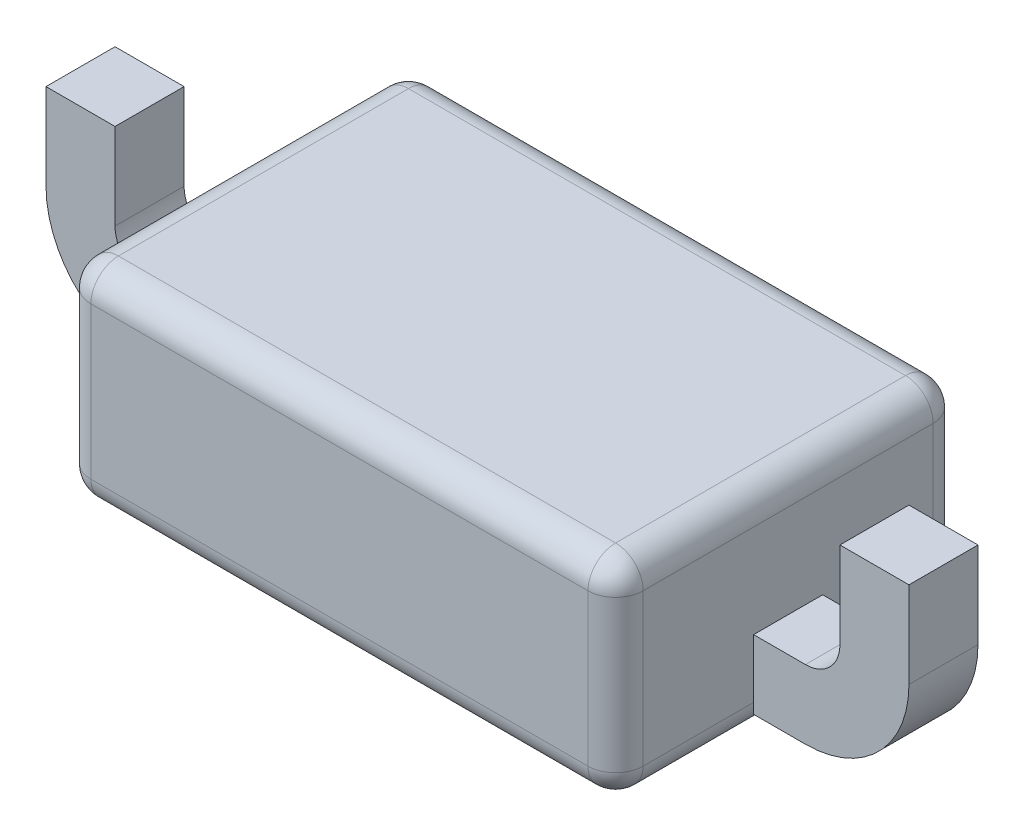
ISO-10303-21;
HEADER;
FILE_DESCRIPTION(('STEP AP214'),'2;1');
FILE_NAME('part.step','',(''),(''),'','','');
FILE_SCHEMA(('AUTOMOTIVE_DESIGN { 1 0 10303 214 1 1 1 1 }'));
ENDSEC;
DATA;
#1=APPLICATION_CONTEXT('core data for automotive mechanical design processes');
#2=APPLICATION_PROTOCOL_DEFINITION('international standard','automotive_design',2000,#1);
#3=PRODUCT_CONTEXT('',#1,'mechanical');
#4=PRODUCT('Part','Part','',(#3));
#5=PRODUCT_RELATED_PRODUCT_CATEGORY('part','',(#4));
#6=PRODUCT_DEFINITION_FORMATION('','',#4);
#7=PRODUCT_DEFINITION_CONTEXT('part definition',#1,'design');
#8=PRODUCT_DEFINITION('design','',#6,#7);
#9=PRODUCT_DEFINITION_SHAPE('','',#8);
#10=(LENGTH_UNIT() NAMED_UNIT(*) SI_UNIT(.MILLI.,.METRE.));
#11=(NAMED_UNIT(*) PLANE_ANGLE_UNIT() SI_UNIT($,.RADIAN.));
#12=(NAMED_UNIT(*) SI_UNIT($,.STERADIAN.) SOLID_ANGLE_UNIT());
#13=UNCERTAINTY_MEASURE_WITH_UNIT(LENGTH_MEASURE(1.E-05),#10,'distance_accuracy_value','');
#14=(GEOMETRIC_REPRESENTATION_CONTEXT(3) GLOBAL_UNCERTAINTY_ASSIGNED_CONTEXT((#13)) GLOBAL_UNIT_ASSIGNED_CONTEXT((#10,
#11,#12)) REPRESENTATION_CONTEXT('',''));
#15=CARTESIAN_POINT('',(0.,0.,0.));
#16=DIRECTION('',(0.,0.,1.));
#17=DIRECTION('',(1.,0.,0.));
#18=AXIS2_PLACEMENT_3D('',#15,#16,#17);
#19=CARTESIAN_POINT('',(1.25,0.,0.1));
#20=DIRECTION('',(0.,0.,1.));
#21=DIRECTION('',(1.,0.,0.));
#22=AXIS2_PLACEMENT_3D('',#19,#20,#21);
#23=PLANE('',#22);
#24=CARTESIAN_POINT('',(0.95,-0.25,0.1));
#25=DIRECTION('',(0.,0.,-1.));
#26=DIRECTION('',(-1.,0.,0.));
#27=AXIS2_PLACEMENT_3D('',#24,#25,#26);
#28=CIRCLE('',#27,0.3);
#29=CARTESIAN_POINT('',(1.25,-0.25,0.1));
#30=VERTEX_POINT('',#29);
#31=CARTESIAN_POINT('',(0.95,-0.55,0.1));
#32=VERTEX_POINT('',#31);
#33=EDGE_CURVE('P0_E21',#30,#32,#28,.T.);
#34=ORIENTED_EDGE('',*,*,#33,.F.);
#35=DIRECTION('',(0.,1.,0.));
#36=VECTOR('',#35,1.);
#37=CARTESIAN_POINT('',(1.25,0.,0.1));
#38=LINE('',#37,#36);
#39=CARTESIAN_POINT('',(1.25,0.,0.1));
#40=VERTEX_POINT('',#39);
#41=EDGE_CURVE('P0_E64',#40,#30,#38,.F.);
#42=ORIENTED_EDGE('',*,*,#41,.F.);
#43=DIRECTION('',(-1.,0.,0.));
#44=VECTOR('',#43,1.);
#45=CARTESIAN_POINT('',(1.15,0.,0.1));
#46=LINE('',#45,#44);
#47=CARTESIAN_POINT('',(1.05,0.,0.1));
#48=VERTEX_POINT('',#47);
#49=EDGE_CURVE('P0_E74',#48,#40,#46,.F.);
#50=ORIENTED_EDGE('',*,*,#49,.F.);
#51=DIRECTION('',(0.,-1.,0.));
#52=VECTOR('',#51,1.);
#53=CARTESIAN_POINT('',(1.05,0.,0.1));
#54=LINE('',#53,#52);
#55=CARTESIAN_POINT('',(1.05,-0.25,0.1));
#56=VERTEX_POINT('',#55);
#57=EDGE_CURVE('P0_E80',#56,#48,#54,.F.);
#58=ORIENTED_EDGE('',*,*,#57,.F.);
#59=CARTESIAN_POINT('',(0.95,-0.25,0.1));
#60=DIRECTION('',(0.,0.,-1.));
#61=DIRECTION('',(-1.,0.,0.));
#62=AXIS2_PLACEMENT_3D('',#59,#60,#61);
#63=CIRCLE('',#62,0.1);
#64=CARTESIAN_POINT('',(0.95,-0.35,0.1));
#65=VERTEX_POINT('',#64);
#66=EDGE_CURVE('P0_E108',#56,#65,#63,.T.);
#67=ORIENTED_EDGE('',*,*,#66,.T.);
#68=DIRECTION('',(1.,0.,0.));
#69=VECTOR('',#68,1.);
#70=CARTESIAN_POINT('',(0.95,-0.35,0.1));
#71=LINE('',#70,#69);
#72=CARTESIAN_POINT('',(0.8,-0.35,0.1));
#73=VERTEX_POINT('',#72);
#74=EDGE_CURVE('P0_E105',#73,#65,#71,.T.);
#75=ORIENTED_EDGE('',*,*,#74,.F.);
#76=DIRECTION('',(0.,1.,0.));
#77=VECTOR('',#76,1.);
#78=CARTESIAN_POINT('',(0.8,-0.45,0.1));
#79=LINE('',#78,#77);
#80=CARTESIAN_POINT('',(0.8,-0.55,0.1));
#81=VERTEX_POINT('',#80);
#82=EDGE_CURVE('P0_E112',#73,#81,#79,.F.);
#83=ORIENTED_EDGE('',*,*,#82,.T.);
#84=DIRECTION('',(1.,0.,0.));
#85=VECTOR('',#84,1.);
#86=CARTESIAN_POINT('',(0.95,-0.55,0.1));
#87=LINE('',#86,#85);
#88=EDGE_CURVE('P0_E118',#32,#81,#87,.F.);
#89=ORIENTED_EDGE('',*,*,#88,.F.);
#90=EDGE_LOOP('',(#34,#42,#50,#58,#67,#75,#83,#89));
#91=FACE_BOUND('',#90,.T.);
#92=ADVANCED_FACE('P0_F17',(#91),#23,.T.);
#93=CARTESIAN_POINT('',(1.15,0.,0.));
#94=DIRECTION('',(0.,1.,0.));
#95=DIRECTION('',(-1.,0.,0.));
#96=AXIS2_PLACEMENT_3D('',#93,#94,#95);
#97=PLANE('',#96);
#98=DIRECTION('',(-1.,0.,0.));
#99=VECTOR('',#98,1.);
#100=CARTESIAN_POINT('',(1.05,0.,-0.1));
#101=LINE('',#100,#99);
#102=CARTESIAN_POINT('',(1.05,0.,-0.1));
#103=VERTEX_POINT('',#102);
#104=CARTESIAN_POINT('',(1.25,0.,-0.1));
#105=VERTEX_POINT('',#104);
#106=EDGE_CURVE('P0_E88',#103,#105,#101,.F.);
#107=ORIENTED_EDGE('',*,*,#106,.F.);
#108=DIRECTION('',(0.,0.,1.));
#109=VECTOR('',#108,1.);
#110=CARTESIAN_POINT('',(1.05,0.,0.1));
#111=LINE('',#110,#109);
#112=EDGE_CURVE('P0_E85',#48,#103,#111,.F.);
#113=ORIENTED_EDGE('',*,*,#112,.F.);
#114=ORIENTED_EDGE('',*,*,#49,.T.);
#115=DIRECTION('',(0.,0.,1.));
#116=VECTOR('',#115,1.);
#117=CARTESIAN_POINT('',(1.25,0.,-0.1));
#118=LINE('',#117,#116);
#119=EDGE_CURVE('P0_E81',#105,#40,#118,.T.);
#120=ORIENTED_EDGE('',*,*,#119,.F.);
#121=EDGE_LOOP('',(#107,#113,#114,#120));
#122=FACE_BOUND('',#121,.T.);
#123=ADVANCED_FACE('P0_F86',(#122),#97,.T.);
#124=CARTESIAN_POINT('',(1.25,0.,-0.1));
#125=DIRECTION('',(1.,0.,0.));
#126=DIRECTION('',(0.,1.,0.));
#127=AXIS2_PLACEMENT_3D('',#124,#125,#126);
#128=PLANE('',#127);
#129=DIRECTION('',(0.,0.,-1.));
#130=VECTOR('',#129,1.);
#131=CARTESIAN_POINT('',(1.25,-0.25,0.));
#132=LINE('',#131,#130);
#133=CARTESIAN_POINT('',(1.25,-0.25,-0.1));
#134=VERTEX_POINT('',#133);
#135=EDGE_CURVE('P0_E125',#134,#30,#132,.F.);
#136=ORIENTED_EDGE('',*,*,#135,.F.);
#137=DIRECTION('',(0.,1.,0.));
#138=VECTOR('',#137,1.);
#139=CARTESIAN_POINT('',(1.25,0.,-0.1));
#140=LINE('',#139,#138);
#141=EDGE_CURVE('P0_E94',#105,#134,#140,.F.);
#142=ORIENTED_EDGE('',*,*,#141,.F.);
#143=ORIENTED_EDGE('',*,*,#119,.T.);
#144=ORIENTED_EDGE('',*,*,#41,.T.);
#145=EDGE_LOOP('',(#136,#142,#143,#144));
#146=FACE_BOUND('',#145,.T.);
#147=ADVANCED_FACE('P0_F159',(#146),#128,.T.);
#148=CARTESIAN_POINT('',(0.95,-0.25,0.));
#149=DIRECTION('',(0.,0.,-1.));
#150=DIRECTION('',(-1.,0.,0.));
#151=AXIS2_PLACEMENT_3D('',#148,#149,#150);
#152=CYLINDRICAL_SURFACE('',#151,0.3);
#153=DIRECTION('',(0.,0.,-1.));
#154=VECTOR('',#153,1.);
#155=CARTESIAN_POINT('',(0.95,-0.55,-0.1));
#156=LINE('',#155,#154);
#157=CARTESIAN_POINT('',(0.95,-0.55,-0.1));
#158=VERTEX_POINT('',#157);
#159=EDGE_CURVE('P0_E121',#158,#32,#156,.F.);
#160=ORIENTED_EDGE('',*,*,#159,.F.);
#161=CARTESIAN_POINT('',(0.95,-0.25,-0.1));
#162=DIRECTION('',(0.,0.,-1.));
#163=DIRECTION('',(-1.,0.,0.));
#164=AXIS2_PLACEMENT_3D('',#161,#162,#163);
#165=CIRCLE('',#164,0.3);
#166=EDGE_CURVE('P0_E131',#134,#158,#165,.T.);
#167=ORIENTED_EDGE('',*,*,#166,.F.);
#168=ORIENTED_EDGE('',*,*,#135,.T.);
#169=ORIENTED_EDGE('',*,*,#33,.T.);
#170=EDGE_LOOP('',(#160,#167,#168,#169));
#171=FACE_BOUND('',#170,.T.);
#172=ADVANCED_FACE('P0_F231',(#171),#152,.T.);
#173=CARTESIAN_POINT('',(0.95,-0.55,-0.1));
#174=DIRECTION('',(0.,-1.,0.));
#175=DIRECTION('',(0.,0.,-1.));
#176=AXIS2_PLACEMENT_3D('',#173,#174,#175);
#177=PLANE('',#176);
#178=DIRECTION('',(0.,0.,1.));
#179=VECTOR('',#178,1.);
#180=CARTESIAN_POINT('',(0.8,-0.55,0.));
#181=LINE('',#180,#179);
#182=CARTESIAN_POINT('',(0.8,-0.55,-0.1));
#183=VERTEX_POINT('',#182);
#184=EDGE_CURVE('P0_E115',#81,#183,#181,.F.);
#185=ORIENTED_EDGE('',*,*,#184,.T.);
#186=DIRECTION('',(-1.,0.,0.));
#187=VECTOR('',#186,1.);
#188=CARTESIAN_POINT('',(1.05,-0.55,-0.1));
#189=LINE('',#188,#187);
#190=EDGE_CURVE('P0_E133',#158,#183,#189,.T.);
#191=ORIENTED_EDGE('',*,*,#190,.F.);
#192=ORIENTED_EDGE('',*,*,#159,.T.);
#193=ORIENTED_EDGE('',*,*,#88,.T.);
#194=EDGE_LOOP('',(#185,#191,#192,#193));
#195=FACE_BOUND('',#194,.T.);
#196=ADVANCED_FACE('P0_F169',(#195),#177,.T.);
#197=CARTESIAN_POINT('',(0.8,-0.45,0.));
#198=DIRECTION('',(1.,0.,0.));
#199=DIRECTION('',(0.,1.,0.));
#200=AXIS2_PLACEMENT_3D('',#197,#198,#199);
#201=PLANE('',#200);
#202=DIRECTION('',(0.,0.,1.));
#203=VECTOR('',#202,1.);
#204=CARTESIAN_POINT('',(0.8,-0.35,0.1));
#205=LINE('',#204,#203);
#206=CARTESIAN_POINT('',(0.8,-0.35,-0.1));
#207=VERTEX_POINT('',#206);
#208=EDGE_CURVE('P0_E109',#207,#73,#205,.T.);
#209=ORIENTED_EDGE('',*,*,#208,.F.);
#210=DIRECTION('',(0.,1.,0.));
#211=VECTOR('',#210,1.);
#212=CARTESIAN_POINT('',(0.8,0.,-0.1));
#213=LINE('',#212,#211);
#214=EDGE_CURVE('P0_E146',#183,#207,#213,.T.);
#215=ORIENTED_EDGE('',*,*,#214,.F.);
#216=ORIENTED_EDGE('',*,*,#184,.F.);
#217=ORIENTED_EDGE('',*,*,#82,.F.);
#218=EDGE_LOOP('',(#209,#215,#216,#217));
#219=FACE_BOUND('',#218,.T.);
#220=ADVANCED_FACE('P0_F174',(#219),#201,.F.);
#221=CARTESIAN_POINT('',(0.95,-0.35,0.1));
#222=DIRECTION('',(0.,1.,0.));
#223=DIRECTION('',(0.,0.,1.));
#224=AXIS2_PLACEMENT_3D('',#221,#222,#223);
#225=PLANE('',#224);
#226=ORIENTED_EDGE('',*,*,#208,.T.);
#227=ORIENTED_EDGE('',*,*,#74,.T.);
#228=DIRECTION('',(0.,0.,-1.));
#229=VECTOR('',#228,1.);
#230=CARTESIAN_POINT('',(0.95,-0.35,0.));
#231=LINE('',#230,#229);
#232=CARTESIAN_POINT('',(0.95,-0.35,-0.1));
#233=VERTEX_POINT('',#232);
#234=EDGE_CURVE('P0_E90',#65,#233,#231,.T.);
#235=ORIENTED_EDGE('',*,*,#234,.T.);
#236=DIRECTION('',(-1.,0.,0.));
#237=VECTOR('',#236,1.);
#238=CARTESIAN_POINT('',(1.05,-0.35,-0.1));
#239=LINE('',#238,#237);
#240=EDGE_CURVE('P0_E130',#207,#233,#239,.F.);
#241=ORIENTED_EDGE('',*,*,#240,.F.);
#242=EDGE_LOOP('',(#226,#227,#235,#241));
#243=FACE_BOUND('',#242,.T.);
#244=ADVANCED_FACE('P0_F192',(#243),#225,.T.);
#245=CARTESIAN_POINT('',(0.95,-0.25,0.));
#246=DIRECTION('',(0.,0.,-1.));
#247=DIRECTION('',(-1.,0.,0.));
#248=AXIS2_PLACEMENT_3D('',#245,#246,#247);
#249=CYLINDRICAL_SURFACE('',#248,0.1);
#250=CARTESIAN_POINT('',(0.95,-0.25,-0.1));
#251=DIRECTION('',(0.,0.,-1.));
#252=DIRECTION('',(-1.,0.,0.));
#253=AXIS2_PLACEMENT_3D('',#250,#251,#252);
#254=CIRCLE('',#253,0.1);
#255=CARTESIAN_POINT('',(1.05,-0.25,-0.1));
#256=VERTEX_POINT('',#255);
#257=EDGE_CURVE('P0_E27',#233,#256,#254,.F.);
#258=ORIENTED_EDGE('',*,*,#257,.F.);
#259=ORIENTED_EDGE('',*,*,#234,.F.);
#260=ORIENTED_EDGE('',*,*,#66,.F.);
#261=DIRECTION('',(0.,0.,1.));
#262=VECTOR('',#261,1.);
#263=CARTESIAN_POINT('',(1.05,-0.25,0.1));
#264=LINE('',#263,#262);
#265=EDGE_CURVE('P0_E36',#256,#56,#264,.T.);
#266=ORIENTED_EDGE('',*,*,#265,.F.);
#267=EDGE_LOOP('',(#258,#259,#260,#266));
#268=FACE_BOUND('',#267,.T.);
#269=ADVANCED_FACE('P0_F190',(#268),#249,.F.);
#270=CARTESIAN_POINT('',(1.05,0.,0.1));
#271=DIRECTION('',(-1.,0.,0.));
#272=DIRECTION('',(0.,-1.,0.));
#273=AXIS2_PLACEMENT_3D('',#270,#271,#272);
#274=PLANE('',#273);
#275=ORIENTED_EDGE('',*,*,#265,.T.);
#276=ORIENTED_EDGE('',*,*,#57,.T.);
#277=ORIENTED_EDGE('',*,*,#112,.T.);
#278=DIRECTION('',(0.,1.,0.));
#279=VECTOR('',#278,1.);
#280=CARTESIAN_POINT('',(1.05,0.,-0.1));
#281=LINE('',#280,#279);
#282=EDGE_CURVE('P0_E11',#256,#103,#281,.T.);
#283=ORIENTED_EDGE('',*,*,#282,.F.);
#284=EDGE_LOOP('',(#275,#276,#277,#283));
#285=FACE_BOUND('',#284,.T.);
#286=ADVANCED_FACE('P0_F92',(#285),#274,.T.);
#287=CARTESIAN_POINT('',(1.05,0.,-0.1));
#288=DIRECTION('',(0.,0.,-1.));
#289=DIRECTION('',(-1.,0.,0.));
#290=AXIS2_PLACEMENT_3D('',#287,#288,#289);
#291=PLANE('',#290);
#292=ORIENTED_EDGE('',*,*,#257,.T.);
#293=ORIENTED_EDGE('',*,*,#282,.T.);
#294=ORIENTED_EDGE('',*,*,#106,.T.);
#295=ORIENTED_EDGE('',*,*,#141,.T.);
#296=ORIENTED_EDGE('',*,*,#166,.T.);
#297=ORIENTED_EDGE('',*,*,#190,.T.);
#298=ORIENTED_EDGE('',*,*,#214,.T.);
#299=ORIENTED_EDGE('',*,*,#240,.T.);
#300=EDGE_LOOP('',(#292,#293,#294,#295,#296,#297,#298,#299));
#301=FACE_BOUND('',#300,.T.);
#302=ADVANCED_FACE('P0_F19',(#301),#291,.T.);
#303=CLOSED_SHELL('',(#92,#123,#147,#172,#196,#220,#244,#269,#286,#302));
#304=MANIFOLD_SOLID_BREP('P0_B1',#303);
#305=CARTESIAN_POINT('',(-0.72,-0.08,-0.42));
#306=DIRECTION('',(-0.577350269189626,0.577350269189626,-0.577350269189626));
#307=DIRECTION('',(0.707106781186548,0.,-0.707106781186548));
#308=AXIS2_PLACEMENT_3D('',#305,#306,#307);
#309=SPHERICAL_SURFACE('',#308,0.08);
#310=CARTESIAN_POINT('',(-0.76618802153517,-0.03381197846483,-0.46618802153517));
#311=VERTEX_POINT('',#310);
#312=VERTEX_LOOP('',#311);
#313=FACE_BOUND('',#312,.T.);
#314=CARTESIAN_POINT('',(-0.72,-0.08,-0.42));
#315=DIRECTION('',(1.,0.,0.));
#316=DIRECTION('',(0.,0.,-1.));
#317=AXIS2_PLACEMENT_3D('',#314,#315,#316);
#318=CIRCLE('',#317,0.08);
#319=CARTESIAN_POINT('',(-0.72,-0.08,-0.5));
#320=VERTEX_POINT('',#319);
#321=CARTESIAN_POINT('',(-0.72,0.,-0.42));
#322=VERTEX_POINT('',#321);
#323=EDGE_CURVE('P1_E225',#320,#322,#318,.T.);
#324=ORIENTED_EDGE('',*,*,#323,.F.);
#325=CARTESIAN_POINT('',(-0.72,-0.08,-0.42));
#326=DIRECTION('',(0.,-1.,0.));
#327=DIRECTION('',(0.,0.,-1.));
#328=AXIS2_PLACEMENT_3D('',#325,#326,#327);
#329=CIRCLE('',#328,0.08);
#330=CARTESIAN_POINT('',(-0.8,-0.08,-0.42));
#331=VERTEX_POINT('',#330);
#332=EDGE_CURVE('P1_E221',#331,#320,#329,.T.);
#333=ORIENTED_EDGE('',*,*,#332,.F.);
#334=CARTESIAN_POINT('',(-0.72,-0.08,-0.42));
#335=DIRECTION('',(0.,0.,-1.));
#336=DIRECTION('',(-1.,0.,0.));
#337=AXIS2_PLACEMENT_3D('',#334,#335,#336);
#338=CIRCLE('',#337,0.08);
#339=EDGE_CURVE('P1_E21',#322,#331,#338,.F.);
#340=ORIENTED_EDGE('',*,*,#339,.F.);
#341=EDGE_LOOP('',(#324,#333,#340));
#342=FACE_BOUND('',#341,.T.);
#343=ADVANCED_FACE('P1_F17',(#313,#342),#309,.T.);
#344=CARTESIAN_POINT('',(0.72,-0.08,-0.42));
#345=DIRECTION('',(0.577350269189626,0.577350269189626,-0.577350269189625));
#346=DIRECTION('',(0.707106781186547,-0.707106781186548,0.));
#347=AXIS2_PLACEMENT_3D('',#344,#345,#346);
#348=SPHERICAL_SURFACE('',#347,0.08);
#349=CARTESIAN_POINT('',(0.76618802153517,-0.0338119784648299,-0.46618802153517));
#350=VERTEX_POINT('',#349);
#351=VERTEX_LOOP('',#350);
#352=FACE_BOUND('',#351,.T.);
#353=CARTESIAN_POINT('',(0.72,-0.08,-0.42));
#354=DIRECTION('',(1.,0.,0.));
#355=DIRECTION('',(0.,0.,-1.));
#356=AXIS2_PLACEMENT_3D('',#353,#354,#355);
#357=CIRCLE('',#356,0.08);
#358=CARTESIAN_POINT('',(0.72,0.,-0.42));
#359=VERTEX_POINT('',#358);
#360=CARTESIAN_POINT('',(0.72,-0.08,-0.5));
#361=VERTEX_POINT('',#360);
#362=EDGE_CURVE('P1_E227',#359,#361,#357,.F.);
#363=ORIENTED_EDGE('',*,*,#362,.F.);
#364=CARTESIAN_POINT('',(0.72,-0.08,-0.42));
#365=DIRECTION('',(0.,0.,1.));
#366=DIRECTION('',(1.,0.,0.));
#367=AXIS2_PLACEMENT_3D('',#364,#365,#366);
#368=CIRCLE('',#367,0.08);
#369=CARTESIAN_POINT('',(0.8,-0.08,-0.42));
#370=VERTEX_POINT('',#369);
#371=EDGE_CURVE('P1_E212',#370,#359,#368,.T.);
#372=ORIENTED_EDGE('',*,*,#371,.F.);
#373=CARTESIAN_POINT('',(0.72,-0.08,-0.42));
#374=DIRECTION('',(0.,-1.,0.));
#375=DIRECTION('',(0.,0.,-1.));
#376=AXIS2_PLACEMENT_3D('',#373,#374,#375);
#377=CIRCLE('',#376,0.08);
#378=EDGE_CURVE('P1_E218',#361,#370,#377,.T.);
#379=ORIENTED_EDGE('',*,*,#378,.F.);
#380=EDGE_LOOP('',(#363,#372,#379));
#381=FACE_BOUND('',#380,.T.);
#382=ADVANCED_FACE('P1_F269',(#352,#381),#348,.T.);
#383=CARTESIAN_POINT('',(-0.72,-0.08,0.42));
#384=DIRECTION('',(-0.577350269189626,0.577350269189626,0.577350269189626));
#385=DIRECTION('',(0.707106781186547,0.707106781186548,0.));
#386=AXIS2_PLACEMENT_3D('',#383,#384,#385);
#387=SPHERICAL_SURFACE('',#386,0.0800000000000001);
#388=CARTESIAN_POINT('',(-0.76618802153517,-0.0338119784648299,0.46618802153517));
#389=VERTEX_POINT('',#388);
#390=VERTEX_LOOP('',#389);
#391=FACE_BOUND('',#390,.T.);
#392=CARTESIAN_POINT('',(-0.72,-0.08,0.42));
#393=DIRECTION('',(0.,0.,-1.));
#394=DIRECTION('',(-1.,0.,0.));
#395=AXIS2_PLACEMENT_3D('',#392,#393,#394);
#396=CIRCLE('',#395,0.08);
#397=CARTESIAN_POINT('',(-0.8,-0.08,0.42));
#398=VERTEX_POINT('',#397);
#399=CARTESIAN_POINT('',(-0.72,0.,0.42));
#400=VERTEX_POINT('',#399);
#401=EDGE_CURVE('P1_E229',#398,#400,#396,.T.);
#402=ORIENTED_EDGE('',*,*,#401,.F.);
#403=CARTESIAN_POINT('',(-0.72,-0.08,0.42));
#404=DIRECTION('',(0.,-1.,0.));
#405=DIRECTION('',(0.,0.,-1.));
#406=AXIS2_PLACEMENT_3D('',#403,#404,#405);
#407=CIRCLE('',#406,0.08);
#408=CARTESIAN_POINT('',(-0.72,-0.08,0.5));
#409=VERTEX_POINT('',#408);
#410=EDGE_CURVE('P1_E208',#409,#398,#407,.T.);
#411=ORIENTED_EDGE('',*,*,#410,.F.);
#412=CARTESIAN_POINT('',(-0.72,-0.08,0.42));
#413=DIRECTION('',(-1.,0.,0.));
#414=DIRECTION('',(0.,0.,1.));
#415=AXIS2_PLACEMENT_3D('',#412,#413,#414);
#416=CIRCLE('',#415,0.08);
#417=EDGE_CURVE('P1_E202',#400,#409,#416,.F.);
#418=ORIENTED_EDGE('',*,*,#417,.F.);
#419=EDGE_LOOP('',(#402,#411,#418));
#420=FACE_BOUND('',#419,.T.);
#421=ADVANCED_FACE('P1_F292',(#391,#420),#387,.T.);
#422=CARTESIAN_POINT('',(0.72,-0.08,0.42));
#423=DIRECTION('',(0.577350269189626,0.577350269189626,0.577350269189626));
#424=DIRECTION('',(-0.707106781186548,0.,0.707106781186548));
#425=AXIS2_PLACEMENT_3D('',#422,#423,#424);
#426=SPHERICAL_SURFACE('',#425,0.08);
#427=CARTESIAN_POINT('',(0.76618802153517,-0.03381197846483,0.46618802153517));
#428=VERTEX_POINT('',#427);
#429=VERTEX_LOOP('',#428);
#430=FACE_BOUND('',#429,.T.);
#431=CARTESIAN_POINT('',(0.72,-0.08,0.42));
#432=DIRECTION('',(-1.,0.,0.));
#433=DIRECTION('',(0.,0.,1.));
#434=AXIS2_PLACEMENT_3D('',#431,#432,#433);
#435=CIRCLE('',#434,0.08);
#436=CARTESIAN_POINT('',(0.72,-0.08,0.5));
#437=VERTEX_POINT('',#436);
#438=CARTESIAN_POINT('',(0.72,0.,0.42));
#439=VERTEX_POINT('',#438);
#440=EDGE_CURVE('P1_E198',#437,#439,#435,.T.);
#441=ORIENTED_EDGE('',*,*,#440,.F.);
#442=CARTESIAN_POINT('',(0.72,-0.08,0.42));
#443=DIRECTION('',(0.,-1.,0.));
#444=DIRECTION('',(0.,0.,-1.));
#445=AXIS2_PLACEMENT_3D('',#442,#443,#444);
#446=CIRCLE('',#445,0.08);
#447=CARTESIAN_POINT('',(0.8,-0.08,0.42));
#448=VERTEX_POINT('',#447);
#449=EDGE_CURVE('P1_E205',#448,#437,#446,.T.);
#450=ORIENTED_EDGE('',*,*,#449,.F.);
#451=CARTESIAN_POINT('',(0.72,-0.08,0.42));
#452=DIRECTION('',(0.,0.,1.));
#453=DIRECTION('',(1.,0.,0.));
#454=AXIS2_PLACEMENT_3D('',#451,#452,#453);
#455=CIRCLE('',#454,0.08);
#456=EDGE_CURVE('P1_E215',#439,#448,#455,.F.);
#457=ORIENTED_EDGE('',*,*,#456,.F.);
#458=EDGE_LOOP('',(#441,#450,#457));
#459=FACE_BOUND('',#458,.T.);
#460=ADVANCED_FACE('P1_F347',(#430,#459),#426,.T.);
#461=CARTESIAN_POINT('',(0.,0.,0.));
#462=DIRECTION('',(0.,1.,0.));
#463=DIRECTION('',(0.,0.,1.));
#464=AXIS2_PLACEMENT_3D('',#461,#462,#463);
#465=PLANE('',#464);
#466=DIRECTION('',(-1.,0.,0.));
#467=VECTOR('',#466,1.);
#468=CARTESIAN_POINT('',(0.4,0.,0.42));
#469=LINE('',#468,#467);
#470=EDGE_CURVE('P1_E201',#439,#400,#469,.T.);
#471=ORIENTED_EDGE('',*,*,#470,.F.);
#472=DIRECTION('',(0.,0.,1.));
#473=VECTOR('',#472,1.);
#474=CARTESIAN_POINT('',(0.72,0.,-0.25));
#475=LINE('',#474,#473);
#476=EDGE_CURVE('P1_E211',#359,#439,#475,.T.);
#477=ORIENTED_EDGE('',*,*,#476,.F.);
#478=DIRECTION('',(1.,0.,0.));
#479=VECTOR('',#478,1.);
#480=CARTESIAN_POINT('',(-0.4,0.,-0.42));
#481=LINE('',#480,#479);
#482=EDGE_CURVE('P1_E224',#322,#359,#481,.T.);
#483=ORIENTED_EDGE('',*,*,#482,.F.);
#484=DIRECTION('',(0.,0.,-1.));
#485=VECTOR('',#484,1.);
#486=CARTESIAN_POINT('',(-0.72,0.,0.25));
#487=LINE('',#486,#485);
#488=EDGE_CURVE('P1_E163',#400,#322,#487,.T.);
#489=ORIENTED_EDGE('',*,*,#488,.F.);
#490=EDGE_LOOP('',(#471,#477,#483,#489));
#491=FACE_BOUND('',#490,.T.);
#492=ADVANCED_FACE('P1_F262',(#491),#465,.T.);
#493=CARTESIAN_POINT('',(-0.72,-0.08,0.25));
#494=DIRECTION('',(0.,0.,-1.));
#495=DIRECTION('',(-1.,0.,0.));
#496=AXIS2_PLACEMENT_3D('',#493,#494,#495);
#497=CYLINDRICAL_SURFACE('',#496,0.08);
#498=ORIENTED_EDGE('',*,*,#401,.T.);
#499=ORIENTED_EDGE('',*,*,#488,.T.);
#500=ORIENTED_EDGE('',*,*,#339,.T.);
#501=DIRECTION('',(0.,0.,1.));
#502=VECTOR('',#501,1.);
#503=CARTESIAN_POINT('',(-0.8,-0.08,0.5));
#504=LINE('',#503,#502);
#505=EDGE_CURVE('P1_E197',#398,#331,#504,.F.);
#506=ORIENTED_EDGE('',*,*,#505,.F.);
#507=EDGE_LOOP('',(#498,#499,#500,#506));
#508=FACE_BOUND('',#507,.T.);
#509=ADVANCED_FACE('P1_F235',(#508),#497,.T.);
#510=CARTESIAN_POINT('',(-0.4,-0.08,-0.42));
#511=DIRECTION('',(1.,0.,0.));
#512=DIRECTION('',(0.,0.,-1.));
#513=AXIS2_PLACEMENT_3D('',#510,#511,#512);
#514=CYLINDRICAL_SURFACE('',#513,0.08);
#515=ORIENTED_EDGE('',*,*,#323,.T.);
#516=ORIENTED_EDGE('',*,*,#482,.T.);
#517=ORIENTED_EDGE('',*,*,#362,.T.);
#518=DIRECTION('',(-1.,0.,0.));
#519=VECTOR('',#518,1.);
#520=CARTESIAN_POINT('',(-0.8,-0.08,-0.5));
#521=LINE('',#520,#519);
#522=EDGE_CURVE('P1_E196',#320,#361,#521,.F.);
#523=ORIENTED_EDGE('',*,*,#522,.F.);
#524=EDGE_LOOP('',(#515,#516,#517,#523));
#525=FACE_BOUND('',#524,.T.);
#526=ADVANCED_FACE('P1_F256',(#525),#514,.T.);
#527=CARTESIAN_POINT('',(-0.72,0.,-0.42));
#528=DIRECTION('',(0.,-1.,0.));
#529=DIRECTION('',(0.,0.,-1.));
#530=AXIS2_PLACEMENT_3D('',#527,#528,#529);
#531=CYLINDRICAL_SURFACE('',#530,0.08);
#532=ORIENTED_EDGE('',*,*,#332,.T.);
#533=DIRECTION('',(0.,1.,0.));
#534=VECTOR('',#533,1.);
#535=CARTESIAN_POINT('',(-0.72,0.,-0.5));
#536=LINE('',#535,#534);
#537=CARTESIAN_POINT('',(-0.72,-0.52,-0.5));
#538=VERTEX_POINT('',#537);
#539=EDGE_CURVE('P1_E192',#538,#320,#536,.T.);
#540=ORIENTED_EDGE('',*,*,#539,.F.);
#541=CARTESIAN_POINT('',(-0.72,-0.52,-0.42));
#542=DIRECTION('',(0.,-1.,0.));
#543=DIRECTION('',(0.,0.,-1.));
#544=AXIS2_PLACEMENT_3D('',#541,#542,#543);
#545=CIRCLE('',#544,0.08);
#546=CARTESIAN_POINT('',(-0.8,-0.52,-0.42));
#547=VERTEX_POINT('',#546);
#548=EDGE_CURVE('P1_E193',#547,#538,#545,.T.);
#549=ORIENTED_EDGE('',*,*,#548,.F.);
#550=DIRECTION('',(0.,1.,0.));
#551=VECTOR('',#550,1.);
#552=CARTESIAN_POINT('',(-0.8,0.,-0.42));
#553=LINE('',#552,#551);
#554=EDGE_CURVE('P1_E242',#331,#547,#553,.F.);
#555=ORIENTED_EDGE('',*,*,#554,.F.);
#556=EDGE_LOOP('',(#532,#540,#549,#555));
#557=FACE_BOUND('',#556,.T.);
#558=ADVANCED_FACE('P1_F284',(#557),#531,.T.);
#559=CARTESIAN_POINT('',(0.72,0.,-0.42));
#560=DIRECTION('',(0.,-1.,0.));
#561=DIRECTION('',(0.,0.,-1.));
#562=AXIS2_PLACEMENT_3D('',#559,#560,#561);
#563=CYLINDRICAL_SURFACE('',#562,0.08);
#564=ORIENTED_EDGE('',*,*,#378,.T.);
#565=DIRECTION('',(0.,1.,0.));
#566=VECTOR('',#565,1.);
#567=CARTESIAN_POINT('',(0.8,0.,-0.42));
#568=LINE('',#567,#566);
#569=CARTESIAN_POINT('',(0.8,-0.52,-0.42));
#570=VERTEX_POINT('',#569);
#571=EDGE_CURVE('P1_E272',#570,#370,#568,.T.);
#572=ORIENTED_EDGE('',*,*,#571,.F.);
#573=CARTESIAN_POINT('',(0.72,-0.52,-0.42));
#574=DIRECTION('',(0.,-1.,0.));
#575=DIRECTION('',(0.,0.,-1.));
#576=AXIS2_PLACEMENT_3D('',#573,#574,#575);
#577=CIRCLE('',#576,0.08);
#578=CARTESIAN_POINT('',(0.72,-0.52,-0.5));
#579=VERTEX_POINT('',#578);
#580=EDGE_CURVE('P1_E188',#579,#570,#577,.T.);
#581=ORIENTED_EDGE('',*,*,#580,.F.);
#582=DIRECTION('',(0.,1.,0.));
#583=VECTOR('',#582,1.);
#584=CARTESIAN_POINT('',(0.72,0.,-0.5));
#585=LINE('',#584,#583);
#586=EDGE_CURVE('P1_E274',#361,#579,#585,.F.);
#587=ORIENTED_EDGE('',*,*,#586,.F.);
#588=EDGE_LOOP('',(#564,#572,#581,#587));
#589=FACE_BOUND('',#588,.T.);
#590=ADVANCED_FACE('P1_F271',(#589),#563,.T.);
#591=CARTESIAN_POINT('',(0.72,-0.08,-0.25));
#592=DIRECTION('',(0.,0.,1.));
#593=DIRECTION('',(1.,0.,0.));
#594=AXIS2_PLACEMENT_3D('',#591,#592,#593);
#595=CYLINDRICAL_SURFACE('',#594,0.08);
#596=ORIENTED_EDGE('',*,*,#371,.T.);
#597=ORIENTED_EDGE('',*,*,#476,.T.);
#598=ORIENTED_EDGE('',*,*,#456,.T.);
#599=DIRECTION('',(0.,0.,-1.));
#600=VECTOR('',#599,1.);
#601=CARTESIAN_POINT('',(0.8,-0.08,-0.5));
#602=LINE('',#601,#600);
#603=EDGE_CURVE('P1_E187',#370,#448,#602,.F.);
#604=ORIENTED_EDGE('',*,*,#603,.F.);
#605=EDGE_LOOP('',(#596,#597,#598,#604));
#606=FACE_BOUND('',#605,.T.);
#607=ADVANCED_FACE('P1_F264',(#606),#595,.T.);
#608=CARTESIAN_POINT('',(-0.72,0.,0.42));
#609=DIRECTION('',(0.,-1.,0.));
#610=DIRECTION('',(0.,0.,-1.));
#611=AXIS2_PLACEMENT_3D('',#608,#609,#610);
#612=CYLINDRICAL_SURFACE('',#611,0.08);
#613=ORIENTED_EDGE('',*,*,#410,.T.);
#614=DIRECTION('',(0.,1.,0.));
#615=VECTOR('',#614,1.);
#616=CARTESIAN_POINT('',(-0.8,0.,0.42));
#617=LINE('',#616,#615);
#618=CARTESIAN_POINT('',(-0.8,-0.52,0.42));
#619=VERTEX_POINT('',#618);
#620=EDGE_CURVE('P1_E244',#619,#398,#617,.T.);
#621=ORIENTED_EDGE('',*,*,#620,.F.);
#622=CARTESIAN_POINT('',(-0.72,-0.52,0.42));
#623=DIRECTION('',(0.,-1.,0.));
#624=DIRECTION('',(0.,0.,-1.));
#625=AXIS2_PLACEMENT_3D('',#622,#623,#624);
#626=CIRCLE('',#625,0.08);
#627=CARTESIAN_POINT('',(-0.72,-0.52,0.5));
#628=VERTEX_POINT('',#627);
#629=EDGE_CURVE('P1_E141',#628,#619,#626,.T.);
#630=ORIENTED_EDGE('',*,*,#629,.F.);
#631=DIRECTION('',(0.,1.,0.));
#632=VECTOR('',#631,1.);
#633=CARTESIAN_POINT('',(-0.72,0.,0.5));
#634=LINE('',#633,#632);
#635=EDGE_CURVE('P1_E140',#409,#628,#634,.F.);
#636=ORIENTED_EDGE('',*,*,#635,.F.);
#637=EDGE_LOOP('',(#613,#621,#630,#636));
#638=FACE_BOUND('',#637,.T.);
#639=ADVANCED_FACE('P1_F340',(#638),#612,.T.);
#640=CARTESIAN_POINT('',(0.72,0.,0.42));
#641=DIRECTION('',(0.,-1.,0.));
#642=DIRECTION('',(0.,0.,-1.));
#643=AXIS2_PLACEMENT_3D('',#640,#641,#642);
#644=CYLINDRICAL_SURFACE('',#643,0.08);
#645=ORIENTED_EDGE('',*,*,#449,.T.);
#646=DIRECTION('',(0.,1.,0.));
#647=VECTOR('',#646,1.);
#648=CARTESIAN_POINT('',(0.72,0.,0.5));
#649=LINE('',#648,#647);
#650=CARTESIAN_POINT('',(0.72,-0.52,0.5));
#651=VERTEX_POINT('',#650);
#652=EDGE_CURVE('P1_E149',#651,#437,#649,.T.);
#653=ORIENTED_EDGE('',*,*,#652,.F.);
#654=CARTESIAN_POINT('',(0.72,-0.52,0.42));
#655=DIRECTION('',(0.,-1.,0.));
#656=DIRECTION('',(0.,0.,-1.));
#657=AXIS2_PLACEMENT_3D('',#654,#655,#656);
#658=CIRCLE('',#657,0.08);
#659=CARTESIAN_POINT('',(0.8,-0.52,0.42));
#660=VERTEX_POINT('',#659);
#661=EDGE_CURVE('P1_E134',#660,#651,#658,.T.);
#662=ORIENTED_EDGE('',*,*,#661,.F.);
#663=DIRECTION('',(0.,1.,0.));
#664=VECTOR('',#663,1.);
#665=CARTESIAN_POINT('',(0.8,0.,0.42));
#666=LINE('',#665,#664);
#667=EDGE_CURVE('P1_E191',#448,#660,#666,.F.);
#668=ORIENTED_EDGE('',*,*,#667,.F.);
#669=EDGE_LOOP('',(#645,#653,#662,#668));
#670=FACE_BOUND('',#669,.T.);
#671=ADVANCED_FACE('P1_F348',(#670),#644,.T.);
#672=CARTESIAN_POINT('',(0.4,-0.08,0.42));
#673=DIRECTION('',(-1.,0.,0.));
#674=DIRECTION('',(0.,0.,1.));
#675=AXIS2_PLACEMENT_3D('',#672,#673,#674);
#676=CYLINDRICAL_SURFACE('',#675,0.08);
#677=ORIENTED_EDGE('',*,*,#440,.T.);
#678=ORIENTED_EDGE('',*,*,#470,.T.);
#679=ORIENTED_EDGE('',*,*,#417,.T.);
#680=DIRECTION('',(1.,0.,0.));
#681=VECTOR('',#680,1.);
#682=CARTESIAN_POINT('',(0.8,-0.08,0.5));
#683=LINE('',#682,#681);
#684=EDGE_CURVE('P1_E183',#437,#409,#683,.F.);
#685=ORIENTED_EDGE('',*,*,#684,.F.);
#686=EDGE_LOOP('',(#677,#678,#679,#685));
#687=FACE_BOUND('',#686,.T.);
#688=ADVANCED_FACE('P1_F345',(#687),#676,.T.);
#689=CARTESIAN_POINT('',(-0.8,0.,0.5));
#690=DIRECTION('',(-1.,0.,0.));
#691=DIRECTION('',(0.,0.,1.));
#692=AXIS2_PLACEMENT_3D('',#689,#690,#691);
#693=PLANE('',#692);
#694=ORIENTED_EDGE('',*,*,#620,.T.);
#695=ORIENTED_EDGE('',*,*,#505,.T.);
#696=ORIENTED_EDGE('',*,*,#554,.T.);
#697=DIRECTION('',(0.,0.,-1.));
#698=VECTOR('',#697,1.);
#699=CARTESIAN_POINT('',(-0.8,-0.52,0.25));
#700=LINE('',#699,#698);
#701=EDGE_CURVE('P1_E177',#619,#547,#700,.T.);
#702=ORIENTED_EDGE('',*,*,#701,.F.);
#703=EDGE_LOOP('',(#694,#695,#696,#702));
#704=FACE_BOUND('',#703,.T.);
#705=ADVANCED_FACE('P1_F239',(#704),#693,.T.);
#706=CARTESIAN_POINT('',(-0.72,-0.52,-0.42));
#707=DIRECTION('',(-0.577350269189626,-0.577350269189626,-0.577350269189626));
#708=DIRECTION('',(0.707106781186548,0.,-0.707106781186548));
#709=AXIS2_PLACEMENT_3D('',#706,#707,#708);
#710=SPHERICAL_SURFACE('',#709,0.08);
#711=CARTESIAN_POINT('',(-0.76618802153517,-0.56618802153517,-0.46618802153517));
#712=VERTEX_POINT('',#711);
#713=VERTEX_LOOP('',#712);
#714=FACE_BOUND('',#713,.T.);
#715=ORIENTED_EDGE('',*,*,#548,.T.);
#716=CARTESIAN_POINT('',(-0.72,-0.52,-0.42));
#717=DIRECTION('',(1.,0.,0.));
#718=DIRECTION('',(0.,0.,-1.));
#719=AXIS2_PLACEMENT_3D('',#716,#717,#718);
#720=CIRCLE('',#719,0.08);
#721=CARTESIAN_POINT('',(-0.72,-0.6,-0.42));
#722=VERTEX_POINT('',#721);
#723=EDGE_CURVE('P1_E171',#722,#538,#720,.T.);
#724=ORIENTED_EDGE('',*,*,#723,.F.);
#725=CARTESIAN_POINT('',(-0.72,-0.52,-0.42));
#726=DIRECTION('',(0.,0.,-1.));
#727=DIRECTION('',(-1.,0.,0.));
#728=AXIS2_PLACEMENT_3D('',#725,#726,#727);
#729=CIRCLE('',#728,0.08);
#730=EDGE_CURVE('P1_E181',#547,#722,#729,.F.);
#731=ORIENTED_EDGE('',*,*,#730,.F.);
#732=EDGE_LOOP('',(#715,#724,#731));
#733=FACE_BOUND('',#732,.T.);
#734=ADVANCED_FACE('P1_F333',(#714,#733),#710,.T.);
#735=CARTESIAN_POINT('',(-0.8,0.,-0.5));
#736=DIRECTION('',(0.,0.,-1.));
#737=DIRECTION('',(-1.,0.,0.));
#738=AXIS2_PLACEMENT_3D('',#735,#736,#737);
#739=PLANE('',#738);
#740=DIRECTION('',(1.,0.,0.));
#741=VECTOR('',#740,1.);
#742=CARTESIAN_POINT('',(-0.4,-0.52,-0.5));
#743=LINE('',#742,#741);
#744=EDGE_CURVE('P1_E170',#538,#579,#743,.T.);
#745=ORIENTED_EDGE('',*,*,#744,.F.);
#746=ORIENTED_EDGE('',*,*,#539,.T.);
#747=ORIENTED_EDGE('',*,*,#522,.T.);
#748=ORIENTED_EDGE('',*,*,#586,.T.);
#749=EDGE_LOOP('',(#745,#746,#747,#748));
#750=FACE_BOUND('',#749,.T.);
#751=ADVANCED_FACE('P1_F282',(#750),#739,.T.);
#752=CARTESIAN_POINT('',(0.72,-0.52,-0.42));
#753=DIRECTION('',(0.577350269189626,-0.577350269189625,-0.577350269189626));
#754=DIRECTION('',(0.707106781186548,0.,0.707106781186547));
#755=AXIS2_PLACEMENT_3D('',#752,#753,#754);
#756=SPHERICAL_SURFACE('',#755,0.0800000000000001);
#757=CARTESIAN_POINT('',(0.76618802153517,-0.56618802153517,-0.46618802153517));
#758=VERTEX_POINT('',#757);
#759=VERTEX_LOOP('',#758);
#760=FACE_BOUND('',#759,.T.);
#761=ORIENTED_EDGE('',*,*,#580,.T.);
#762=CARTESIAN_POINT('',(0.72,-0.52,-0.42));
#763=DIRECTION('',(0.,0.,1.));
#764=DIRECTION('',(1.,0.,0.));
#765=AXIS2_PLACEMENT_3D('',#762,#763,#764);
#766=CIRCLE('',#765,0.08);
#767=CARTESIAN_POINT('',(0.72,-0.6,-0.42));
#768=VERTEX_POINT('',#767);
#769=EDGE_CURVE('P1_E166',#768,#570,#766,.T.);
#770=ORIENTED_EDGE('',*,*,#769,.F.);
#771=CARTESIAN_POINT('',(0.72,-0.52,-0.42));
#772=DIRECTION('',(1.,0.,0.));
#773=DIRECTION('',(0.,0.,-1.));
#774=AXIS2_PLACEMENT_3D('',#771,#772,#773);
#775=CIRCLE('',#774,0.08);
#776=EDGE_CURVE('P1_E174',#579,#768,#775,.F.);
#777=ORIENTED_EDGE('',*,*,#776,.F.);
#778=EDGE_LOOP('',(#761,#770,#777));
#779=FACE_BOUND('',#778,.T.);
#780=ADVANCED_FACE('P1_F328',(#760,#779),#756,.T.);
#781=CARTESIAN_POINT('',(0.8,0.,-0.5));
#782=DIRECTION('',(1.,0.,0.));
#783=DIRECTION('',(0.,0.,-1.));
#784=AXIS2_PLACEMENT_3D('',#781,#782,#783);
#785=PLANE('',#784);
#786=ORIENTED_EDGE('',*,*,#571,.T.);
#787=ORIENTED_EDGE('',*,*,#603,.T.);
#788=ORIENTED_EDGE('',*,*,#667,.T.);
#789=DIRECTION('',(0.,0.,1.));
#790=VECTOR('',#789,1.);
#791=CARTESIAN_POINT('',(0.8,-0.52,-0.25));
#792=LINE('',#791,#790);
#793=EDGE_CURVE('P1_E160',#570,#660,#792,.T.);
#794=ORIENTED_EDGE('',*,*,#793,.F.);
#795=EDGE_LOOP('',(#786,#787,#788,#794));
#796=FACE_BOUND('',#795,.T.);
#797=ADVANCED_FACE('P1_F325',(#796),#785,.T.);
#798=CARTESIAN_POINT('',(-0.72,-0.52,0.42));
#799=DIRECTION('',(-0.577350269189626,-0.577350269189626,0.577350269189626));
#800=DIRECTION('',(-0.707106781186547,0.707106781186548,0.));
#801=AXIS2_PLACEMENT_3D('',#798,#799,#800);
#802=SPHERICAL_SURFACE('',#801,0.0800000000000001);
#803=CARTESIAN_POINT('',(-0.76618802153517,-0.56618802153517,0.46618802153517));
#804=VERTEX_POINT('',#803);
#805=VERTEX_LOOP('',#804);
#806=FACE_BOUND('',#805,.T.);
#807=ORIENTED_EDGE('',*,*,#629,.T.);
#808=CARTESIAN_POINT('',(-0.72,-0.52,0.42));
#809=DIRECTION('',(0.,0.,-1.));
#810=DIRECTION('',(-1.,0.,0.));
#811=AXIS2_PLACEMENT_3D('',#808,#809,#810);
#812=CIRCLE('',#811,0.08);
#813=CARTESIAN_POINT('',(-0.72,-0.6,0.42));
#814=VERTEX_POINT('',#813);
#815=EDGE_CURVE('P1_E178',#814,#619,#812,.T.);
#816=ORIENTED_EDGE('',*,*,#815,.F.);
#817=CARTESIAN_POINT('',(-0.72,-0.52,0.42));
#818=DIRECTION('',(-1.,0.,0.));
#819=DIRECTION('',(0.,0.,1.));
#820=AXIS2_PLACEMENT_3D('',#817,#818,#819);
#821=CIRCLE('',#820,0.08);
#822=EDGE_CURVE('P1_E158',#628,#814,#821,.F.);
#823=ORIENTED_EDGE('',*,*,#822,.F.);
#824=EDGE_LOOP('',(#807,#816,#823));
#825=FACE_BOUND('',#824,.T.);
#826=ADVANCED_FACE('P1_F132',(#806,#825),#802,.T.);
#827=CARTESIAN_POINT('',(0.72,-0.52,0.42));
#828=DIRECTION('',(0.577350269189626,-0.577350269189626,0.577350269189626));
#829=DIRECTION('',(-0.707106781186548,0.,0.707106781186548));
#830=AXIS2_PLACEMENT_3D('',#827,#828,#829);
#831=SPHERICAL_SURFACE('',#830,0.08);
#832=CARTESIAN_POINT('',(0.76618802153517,-0.56618802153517,0.46618802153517));
#833=VERTEX_POINT('',#832);
#834=VERTEX_LOOP('',#833);
#835=FACE_BOUND('',#834,.T.);
#836=ORIENTED_EDGE('',*,*,#661,.T.);
#837=CARTESIAN_POINT('',(0.72,-0.52,0.42));
#838=DIRECTION('',(-1.,0.,0.));
#839=DIRECTION('',(0.,0.,1.));
#840=AXIS2_PLACEMENT_3D('',#837,#838,#839);
#841=CIRCLE('',#840,0.08);
#842=CARTESIAN_POINT('',(0.72,-0.6,0.42));
#843=VERTEX_POINT('',#842);
#844=EDGE_CURVE('P1_E36',#843,#651,#841,.T.);
#845=ORIENTED_EDGE('',*,*,#844,.F.);
#846=CARTESIAN_POINT('',(0.72,-0.52,0.42));
#847=DIRECTION('',(0.,0.,1.));
#848=DIRECTION('',(1.,0.,0.));
#849=AXIS2_PLACEMENT_3D('',#846,#847,#848);
#850=CIRCLE('',#849,0.08);
#851=EDGE_CURVE('P1_E136',#660,#843,#850,.F.);
#852=ORIENTED_EDGE('',*,*,#851,.F.);
#853=EDGE_LOOP('',(#836,#845,#852));
#854=FACE_BOUND('',#853,.T.);
#855=ADVANCED_FACE('P1_F129',(#835,#854),#831,.T.);
#856=CARTESIAN_POINT('',(0.8,0.,0.5));
#857=DIRECTION('',(0.,0.,1.));
#858=DIRECTION('',(1.,0.,0.));
#859=AXIS2_PLACEMENT_3D('',#856,#857,#858);
#860=PLANE('',#859);
#861=ORIENTED_EDGE('',*,*,#652,.T.);
#862=ORIENTED_EDGE('',*,*,#684,.T.);
#863=ORIENTED_EDGE('',*,*,#635,.T.);
#864=DIRECTION('',(-1.,0.,0.));
#865=VECTOR('',#864,1.);
#866=CARTESIAN_POINT('',(0.4,-0.52,0.5));
#867=LINE('',#866,#865);
#868=EDGE_CURVE('P1_E147',#651,#628,#867,.T.);
#869=ORIENTED_EDGE('',*,*,#868,.F.);
#870=EDGE_LOOP('',(#861,#862,#863,#869));
#871=FACE_BOUND('',#870,.T.);
#872=ADVANCED_FACE('P1_F131',(#871),#860,.T.);
#873=CARTESIAN_POINT('',(-0.72,-0.52,0.25));
#874=DIRECTION('',(0.,0.,-1.));
#875=DIRECTION('',(-1.,0.,0.));
#876=AXIS2_PLACEMENT_3D('',#873,#874,#875);
#877=CYLINDRICAL_SURFACE('',#876,0.08);
#878=ORIENTED_EDGE('',*,*,#815,.T.);
#879=ORIENTED_EDGE('',*,*,#701,.T.);
#880=ORIENTED_EDGE('',*,*,#730,.T.);
#881=DIRECTION('',(0.,0.,-1.));
#882=VECTOR('',#881,1.);
#883=CARTESIAN_POINT('',(-0.72,-0.6,0.));
#884=LINE('',#883,#882);
#885=EDGE_CURVE('P1_E153',#814,#722,#884,.T.);
#886=ORIENTED_EDGE('',*,*,#885,.F.);
#887=EDGE_LOOP('',(#878,#879,#880,#886));
#888=FACE_BOUND('',#887,.T.);
#889=ADVANCED_FACE('P1_F336',(#888),#877,.T.);
#890=CARTESIAN_POINT('',(-0.4,-0.52,-0.42));
#891=DIRECTION('',(1.,0.,0.));
#892=DIRECTION('',(0.,0.,-1.));
#893=AXIS2_PLACEMENT_3D('',#890,#891,#892);
#894=CYLINDRICAL_SURFACE('',#893,0.08);
#895=ORIENTED_EDGE('',*,*,#723,.T.);
#896=ORIENTED_EDGE('',*,*,#744,.T.);
#897=ORIENTED_EDGE('',*,*,#776,.T.);
#898=DIRECTION('',(1.,0.,0.));
#899=VECTOR('',#898,1.);
#900=CARTESIAN_POINT('',(0.,-0.6,-0.42));
#901=LINE('',#900,#899);
#902=EDGE_CURVE('P1_E307',#722,#768,#901,.T.);
#903=ORIENTED_EDGE('',*,*,#902,.F.);
#904=EDGE_LOOP('',(#895,#896,#897,#903));
#905=FACE_BOUND('',#904,.T.);
#906=ADVANCED_FACE('P1_F330',(#905),#894,.T.);
#907=CARTESIAN_POINT('',(0.72,-0.52,-0.25));
#908=DIRECTION('',(0.,0.,1.));
#909=DIRECTION('',(1.,0.,0.));
#910=AXIS2_PLACEMENT_3D('',#907,#908,#909);
#911=CYLINDRICAL_SURFACE('',#910,0.08);
#912=ORIENTED_EDGE('',*,*,#769,.T.);
#913=ORIENTED_EDGE('',*,*,#793,.T.);
#914=ORIENTED_EDGE('',*,*,#851,.T.);
#915=DIRECTION('',(0.,0.,-1.));
#916=VECTOR('',#915,1.);
#917=CARTESIAN_POINT('',(0.72,-0.6,0.));
#918=LINE('',#917,#916);
#919=EDGE_CURVE('P1_E27',#768,#843,#918,.F.);
#920=ORIENTED_EDGE('',*,*,#919,.F.);
#921=EDGE_LOOP('',(#912,#913,#914,#920));
#922=FACE_BOUND('',#921,.T.);
#923=ADVANCED_FACE('P1_F302',(#922),#911,.T.);
#924=CARTESIAN_POINT('',(0.4,-0.52,0.42));
#925=DIRECTION('',(-1.,0.,0.));
#926=DIRECTION('',(0.,0.,1.));
#927=AXIS2_PLACEMENT_3D('',#924,#925,#926);
#928=CYLINDRICAL_SURFACE('',#927,0.08);
#929=ORIENTED_EDGE('',*,*,#844,.T.);
#930=ORIENTED_EDGE('',*,*,#868,.T.);
#931=ORIENTED_EDGE('',*,*,#822,.T.);
#932=DIRECTION('',(1.,0.,0.));
#933=VECTOR('',#932,1.);
#934=CARTESIAN_POINT('',(0.,-0.6,0.42));
#935=LINE('',#934,#933);
#936=EDGE_CURVE('P1_E11',#843,#814,#935,.F.);
#937=ORIENTED_EDGE('',*,*,#936,.F.);
#938=EDGE_LOOP('',(#929,#930,#931,#937));
#939=FACE_BOUND('',#938,.T.);
#940=ADVANCED_FACE('P1_F156',(#939),#928,.T.);
#941=CARTESIAN_POINT('',(0.,-0.6,0.));
#942=DIRECTION('',(0.,-1.,0.));
#943=DIRECTION('',(0.,0.,-1.));
#944=AXIS2_PLACEMENT_3D('',#941,#942,#943);
#945=PLANE('',#944);
#946=ORIENTED_EDGE('',*,*,#919,.T.);
#947=ORIENTED_EDGE('',*,*,#936,.T.);
#948=ORIENTED_EDGE('',*,*,#885,.T.);
#949=ORIENTED_EDGE('',*,*,#902,.T.);
#950=EDGE_LOOP('',(#946,#947,#948,#949));
#951=FACE_BOUND('',#950,.T.);
#952=ADVANCED_FACE('P1_F19',(#951),#945,.T.);
#953=CLOSED_SHELL('',(#343,#382,#421,#460,#492,#509,#526,#558,#590,#607,#639,#671,#688,#705,
#734,#751,#780,#797,#826,#855,#872,#889,#906,#923,#940,#952));
#954=MANIFOLD_SOLID_BREP('P1_B1',#953);
#955=CARTESIAN_POINT('',(-1.25,0.,0.1));
#956=DIRECTION('',(0.,0.,-1.));
#957=DIRECTION('',(-1.,0.,0.));
#958=AXIS2_PLACEMENT_3D('',#955,#956,#957);
#959=PLANE('',#958);
#960=DIRECTION('',(0.,1.,0.));
#961=VECTOR('',#960,1.);
#962=CARTESIAN_POINT('',(-1.25,0.,0.1));
#963=LINE('',#962,#961);
#964=CARTESIAN_POINT('',(-1.25,0.,0.1));
#965=VERTEX_POINT('',#964);
#966=CARTESIAN_POINT('',(-1.25,-0.25,0.1));
#967=VERTEX_POINT('',#966);
#968=EDGE_CURVE('P2_E85',#965,#967,#963,.F.);
#969=ORIENTED_EDGE('',*,*,#968,.T.);
#970=CARTESIAN_POINT('',(-0.95,-0.25,0.1));
#971=DIRECTION('',(0.,0.,1.));
#972=DIRECTION('',(1.,0.,0.));
#973=AXIS2_PLACEMENT_3D('',#970,#971,#972);
#974=CIRCLE('',#973,0.3);
#975=CARTESIAN_POINT('',(-0.95,-0.55,0.1));
#976=VERTEX_POINT('',#975);
#977=EDGE_CURVE('P2_E21',#976,#967,#974,.F.);
#978=ORIENTED_EDGE('',*,*,#977,.F.);
#979=DIRECTION('',(1.,0.,0.));
#980=VECTOR('',#979,1.);
#981=CARTESIAN_POINT('',(-0.95,-0.55,0.1));
#982=LINE('',#981,#980);
#983=CARTESIAN_POINT('',(-0.8,-0.55,0.1));
#984=VERTEX_POINT('',#983);
#985=EDGE_CURVE('P2_E80',#976,#984,#982,.T.);
#986=ORIENTED_EDGE('',*,*,#985,.T.);
#987=DIRECTION('',(0.,1.,0.));
#988=VECTOR('',#987,1.);
#989=CARTESIAN_POINT('',(-0.8,-0.45,0.1));
#990=LINE('',#989,#988);
#991=CARTESIAN_POINT('',(-0.8,-0.35,0.1));
#992=VERTEX_POINT('',#991);
#993=EDGE_CURVE('P2_E127',#992,#984,#990,.F.);
#994=ORIENTED_EDGE('',*,*,#993,.F.);
#995=DIRECTION('',(1.,0.,0.));
#996=VECTOR('',#995,1.);
#997=CARTESIAN_POINT('',(-0.95,-0.35,0.1));
#998=LINE('',#997,#996);
#999=CARTESIAN_POINT('',(-0.95,-0.35,0.1));
#1000=VERTEX_POINT('',#999);
#1001=EDGE_CURVE('P2_E121',#992,#1000,#998,.F.);
#1002=ORIENTED_EDGE('',*,*,#1001,.T.);
#1003=CARTESIAN_POINT('',(-0.95,-0.25,0.1));
#1004=DIRECTION('',(0.,0.,1.));
#1005=DIRECTION('',(1.,0.,0.));
#1006=AXIS2_PLACEMENT_3D('',#1003,#1004,#1005);
#1007=CIRCLE('',#1006,0.1);
#1008=CARTESIAN_POINT('',(-1.05,-0.25,0.1));
#1009=VERTEX_POINT('',#1008);
#1010=EDGE_CURVE('P2_E141',#1000,#1009,#1007,.F.);
#1011=ORIENTED_EDGE('',*,*,#1010,.T.);
#1012=DIRECTION('',(0.,-1.,0.));
#1013=VECTOR('',#1012,1.);
#1014=CARTESIAN_POINT('',(-1.05,0.,0.1));
#1015=LINE('',#1014,#1013);
#1016=CARTESIAN_POINT('',(-1.05,0.,0.1));
#1017=VERTEX_POINT('',#1016);
#1018=EDGE_CURVE('P2_E109',#1009,#1017,#1015,.F.);
#1019=ORIENTED_EDGE('',*,*,#1018,.T.);
#1020=DIRECTION('',(1.,0.,0.));
#1021=VECTOR('',#1020,1.);
#1022=CARTESIAN_POINT('',(-1.15,0.,0.1));
#1023=LINE('',#1022,#1021);
#1024=EDGE_CURVE('P2_E88',#1017,#965,#1023,.F.);
#1025=ORIENTED_EDGE('',*,*,#1024,.T.);
#1026=EDGE_LOOP('',(#969,#978,#986,#994,#1002,#1011,#1019,#1025));
#1027=FACE_BOUND('',#1026,.T.);
#1028=ADVANCED_FACE('P2_F17',(#1027),#959,.F.);
#1029=CARTESIAN_POINT('',(-1.25,0.,-0.1));
#1030=DIRECTION('',(1.,0.,0.));
#1031=DIRECTION('',(0.,1.,0.));
#1032=AXIS2_PLACEMENT_3D('',#1029,#1030,#1031);
#1033=PLANE('',#1032);
#1034=DIRECTION('',(0.,1.,0.));
#1035=VECTOR('',#1034,1.);
#1036=CARTESIAN_POINT('',(-1.25,0.,-0.1));
#1037=LINE('',#1036,#1035);
#1038=CARTESIAN_POINT('',(-1.25,0.,-0.1));
#1039=VERTEX_POINT('',#1038);
#1040=CARTESIAN_POINT('',(-1.25,-0.25,-0.1));
#1041=VERTEX_POINT('',#1040);
#1042=EDGE_CURVE('P2_E102',#1039,#1041,#1037,.F.);
#1043=ORIENTED_EDGE('',*,*,#1042,.T.);
#1044=DIRECTION('',(0.,0.,1.));
#1045=VECTOR('',#1044,1.);
#1046=CARTESIAN_POINT('',(-1.25,-0.25,0.));
#1047=LINE('',#1046,#1045);
#1048=EDGE_CURVE('P2_E93',#967,#1041,#1047,.F.);
#1049=ORIENTED_EDGE('',*,*,#1048,.F.);
#1050=ORIENTED_EDGE('',*,*,#968,.F.);
#1051=DIRECTION('',(0.,0.,1.));
#1052=VECTOR('',#1051,1.);
#1053=CARTESIAN_POINT('',(-1.25,0.,0.));
#1054=LINE('',#1053,#1052);
#1055=EDGE_CURVE('P2_E107',#965,#1039,#1054,.F.);
#1056=ORIENTED_EDGE('',*,*,#1055,.T.);
#1057=EDGE_LOOP('',(#1043,#1049,#1050,#1056));
#1058=FACE_BOUND('',#1057,.T.);
#1059=ADVANCED_FACE('P2_F101',(#1058),#1033,.F.);
#1060=CARTESIAN_POINT('',(-0.95,-0.25,0.));
#1061=DIRECTION('',(0.,0.,1.));
#1062=DIRECTION('',(1.,0.,0.));
#1063=AXIS2_PLACEMENT_3D('',#1060,#1061,#1062);
#1064=CYLINDRICAL_SURFACE('',#1063,0.3);
#1065=DIRECTION('',(0.,0.,1.));
#1066=VECTOR('',#1065,1.);
#1067=CARTESIAN_POINT('',(-0.95,-0.55,-0.1));
#1068=LINE('',#1067,#1066);
#1069=CARTESIAN_POINT('',(-0.95,-0.55,-0.1));
#1070=VERTEX_POINT('',#1069);
#1071=EDGE_CURVE('P2_E99',#1070,#976,#1068,.T.);
#1072=ORIENTED_EDGE('',*,*,#1071,.T.);
#1073=ORIENTED_EDGE('',*,*,#977,.T.);
#1074=ORIENTED_EDGE('',*,*,#1048,.T.);
#1075=CARTESIAN_POINT('',(-0.95,-0.25,-0.1));
#1076=DIRECTION('',(0.,0.,1.));
#1077=DIRECTION('',(1.,0.,0.));
#1078=AXIS2_PLACEMENT_3D('',#1075,#1076,#1077);
#1079=CIRCLE('',#1078,0.3);
#1080=EDGE_CURVE('P2_E139',#1041,#1070,#1079,.T.);
#1081=ORIENTED_EDGE('',*,*,#1080,.T.);
#1082=EDGE_LOOP('',(#1072,#1073,#1074,#1081));
#1083=FACE_BOUND('',#1082,.T.);
#1084=ADVANCED_FACE('P2_F96',(#1083),#1064,.T.);
#1085=CARTESIAN_POINT('',(-0.95,-0.55,-0.1));
#1086=DIRECTION('',(0.,1.,0.));
#1087=DIRECTION('',(0.,0.,1.));
#1088=AXIS2_PLACEMENT_3D('',#1085,#1086,#1087);
#1089=PLANE('',#1088);
#1090=DIRECTION('',(1.,0.,0.));
#1091=VECTOR('',#1090,1.);
#1092=CARTESIAN_POINT('',(-1.05,-0.55,-0.1));
#1093=LINE('',#1092,#1091);
#1094=CARTESIAN_POINT('',(-0.8,-0.55,-0.1));
#1095=VERTEX_POINT('',#1094);
#1096=EDGE_CURVE('P2_E140',#1070,#1095,#1093,.T.);
#1097=ORIENTED_EDGE('',*,*,#1096,.T.);
#1098=DIRECTION('',(0.,0.,1.));
#1099=VECTOR('',#1098,1.);
#1100=CARTESIAN_POINT('',(-0.8,-0.55,0.));
#1101=LINE('',#1100,#1099);
#1102=EDGE_CURVE('P2_E129',#984,#1095,#1101,.F.);
#1103=ORIENTED_EDGE('',*,*,#1102,.F.);
#1104=ORIENTED_EDGE('',*,*,#985,.F.);
#1105=ORIENTED_EDGE('',*,*,#1071,.F.);
#1106=EDGE_LOOP('',(#1097,#1103,#1104,#1105));
#1107=FACE_BOUND('',#1106,.T.);
#1108=ADVANCED_FACE('P2_F174',(#1107),#1089,.F.);
#1109=CARTESIAN_POINT('',(-0.8,-0.45,0.));
#1110=DIRECTION('',(1.,0.,0.));
#1111=DIRECTION('',(0.,1.,0.));
#1112=AXIS2_PLACEMENT_3D('',#1109,#1110,#1111);
#1113=PLANE('',#1112);
#1114=DIRECTION('',(0.,1.,0.));
#1115=VECTOR('',#1114,1.);
#1116=CARTESIAN_POINT('',(-0.8,0.,-0.1));
#1117=LINE('',#1116,#1115);
#1118=CARTESIAN_POINT('',(-0.8,-0.35,-0.1));
#1119=VERTEX_POINT('',#1118);
#1120=EDGE_CURVE('P2_E159',#1095,#1119,#1117,.T.);
#1121=ORIENTED_EDGE('',*,*,#1120,.T.);
#1122=DIRECTION('',(0.,0.,-1.));
#1123=VECTOR('',#1122,1.);
#1124=CARTESIAN_POINT('',(-0.8,-0.35,0.1));
#1125=LINE('',#1124,#1123);
#1126=EDGE_CURVE('P2_E124',#1119,#992,#1125,.F.);
#1127=ORIENTED_EDGE('',*,*,#1126,.T.);
#1128=ORIENTED_EDGE('',*,*,#993,.T.);
#1129=ORIENTED_EDGE('',*,*,#1102,.T.);
#1130=EDGE_LOOP('',(#1121,#1127,#1128,#1129));
#1131=FACE_BOUND('',#1130,.T.);
#1132=ADVANCED_FACE('P2_F167',(#1131),#1113,.T.);
#1133=CARTESIAN_POINT('',(-0.95,-0.35,0.1));
#1134=DIRECTION('',(0.,-1.,0.));
#1135=DIRECTION('',(0.,0.,-1.));
#1136=AXIS2_PLACEMENT_3D('',#1133,#1134,#1135);
#1137=PLANE('',#1136);
#1138=ORIENTED_EDGE('',*,*,#1001,.F.);
#1139=ORIENTED_EDGE('',*,*,#1126,.F.);
#1140=DIRECTION('',(1.,0.,0.));
#1141=VECTOR('',#1140,1.);
#1142=CARTESIAN_POINT('',(-1.05,-0.35,-0.1));
#1143=LINE('',#1142,#1141);
#1144=CARTESIAN_POINT('',(-0.95,-0.35,-0.1));
#1145=VERTEX_POINT('',#1144);
#1146=EDGE_CURVE('P2_E138',#1119,#1145,#1143,.F.);
#1147=ORIENTED_EDGE('',*,*,#1146,.T.);
#1148=DIRECTION('',(0.,0.,1.));
#1149=VECTOR('',#1148,1.);
#1150=CARTESIAN_POINT('',(-0.95,-0.35,0.));
#1151=LINE('',#1150,#1149);
#1152=EDGE_CURVE('P2_E123',#1145,#1000,#1151,.T.);
#1153=ORIENTED_EDGE('',*,*,#1152,.T.);
#1154=EDGE_LOOP('',(#1138,#1139,#1147,#1153));
#1155=FACE_BOUND('',#1154,.T.);
#1156=ADVANCED_FACE('P2_F192',(#1155),#1137,.F.);
#1157=CARTESIAN_POINT('',(-0.95,-0.25,0.));
#1158=DIRECTION('',(0.,0.,1.));
#1159=DIRECTION('',(1.,0.,0.));
#1160=AXIS2_PLACEMENT_3D('',#1157,#1158,#1159);
#1161=CYLINDRICAL_SURFACE('',#1160,0.1);
#1162=ORIENTED_EDGE('',*,*,#1010,.F.);
#1163=ORIENTED_EDGE('',*,*,#1152,.F.);
#1164=CARTESIAN_POINT('',(-0.95,-0.25,-0.1));
#1165=DIRECTION('',(0.,0.,1.));
#1166=DIRECTION('',(1.,0.,0.));
#1167=AXIS2_PLACEMENT_3D('',#1164,#1165,#1166);
#1168=CIRCLE('',#1167,0.1);
#1169=CARTESIAN_POINT('',(-1.05,-0.25,-0.1));
#1170=VERTEX_POINT('',#1169);
#1171=EDGE_CURVE('P2_E135',#1145,#1170,#1168,.F.);
#1172=ORIENTED_EDGE('',*,*,#1171,.T.);
#1173=DIRECTION('',(0.,0.,1.));
#1174=VECTOR('',#1173,1.);
#1175=CARTESIAN_POINT('',(-1.05,-0.25,0.1));
#1176=LINE('',#1175,#1174);
#1177=EDGE_CURVE('P2_E113',#1170,#1009,#1176,.T.);
#1178=ORIENTED_EDGE('',*,*,#1177,.T.);
#1179=EDGE_LOOP('',(#1162,#1163,#1172,#1178));
#1180=FACE_BOUND('',#1179,.T.);
#1181=ADVANCED_FACE('P2_F194',(#1180),#1161,.F.);
#1182=CARTESIAN_POINT('',(-1.05,0.,0.1));
#1183=DIRECTION('',(-1.,0.,0.));
#1184=DIRECTION('',(0.,-1.,0.));
#1185=AXIS2_PLACEMENT_3D('',#1182,#1183,#1184);
#1186=PLANE('',#1185);
#1187=ORIENTED_EDGE('',*,*,#1018,.F.);
#1188=ORIENTED_EDGE('',*,*,#1177,.F.);
#1189=DIRECTION('',(0.,1.,0.));
#1190=VECTOR('',#1189,1.);
#1191=CARTESIAN_POINT('',(-1.05,0.,-0.1));
#1192=LINE('',#1191,#1190);
#1193=CARTESIAN_POINT('',(-1.05,0.,-0.1));
#1194=VERTEX_POINT('',#1193);
#1195=EDGE_CURVE('P2_E27',#1170,#1194,#1192,.T.);
#1196=ORIENTED_EDGE('',*,*,#1195,.T.);
#1197=DIRECTION('',(0.,0.,1.));
#1198=VECTOR('',#1197,1.);
#1199=CARTESIAN_POINT('',(-1.05,0.,0.));
#1200=LINE('',#1199,#1198);
#1201=EDGE_CURVE('P2_E35',#1194,#1017,#1200,.T.);
#1202=ORIENTED_EDGE('',*,*,#1201,.T.);
#1203=EDGE_LOOP('',(#1187,#1188,#1196,#1202));
#1204=FACE_BOUND('',#1203,.T.);
#1205=ADVANCED_FACE('P2_F188',(#1204),#1186,.F.);
#1206=CARTESIAN_POINT('',(-1.15,0.,0.));
#1207=DIRECTION('',(0.,-1.,0.));
#1208=DIRECTION('',(1.,0.,0.));
#1209=AXIS2_PLACEMENT_3D('',#1206,#1207,#1208);
#1210=PLANE('',#1209);
#1211=ORIENTED_EDGE('',*,*,#1201,.F.);
#1212=DIRECTION('',(1.,0.,0.));
#1213=VECTOR('',#1212,1.);
#1214=CARTESIAN_POINT('',(-1.05,0.,-0.1));
#1215=LINE('',#1214,#1213);
#1216=EDGE_CURVE('P2_E11',#1194,#1039,#1215,.F.);
#1217=ORIENTED_EDGE('',*,*,#1216,.T.);
#1218=ORIENTED_EDGE('',*,*,#1055,.F.);
#1219=ORIENTED_EDGE('',*,*,#1024,.F.);
#1220=EDGE_LOOP('',(#1211,#1217,#1218,#1219));
#1221=FACE_BOUND('',#1220,.T.);
#1222=ADVANCED_FACE('P2_F202',(#1221),#1210,.F.);
#1223=CARTESIAN_POINT('',(-1.05,0.,-0.1));
#1224=DIRECTION('',(0.,0.,1.));
#1225=DIRECTION('',(1.,0.,0.));
#1226=AXIS2_PLACEMENT_3D('',#1223,#1224,#1225);
#1227=PLANE('',#1226);
#1228=ORIENTED_EDGE('',*,*,#1195,.F.);
#1229=ORIENTED_EDGE('',*,*,#1171,.F.);
#1230=ORIENTED_EDGE('',*,*,#1146,.F.);
#1231=ORIENTED_EDGE('',*,*,#1120,.F.);
#1232=ORIENTED_EDGE('',*,*,#1096,.F.);
#1233=ORIENTED_EDGE('',*,*,#1080,.F.);
#1234=ORIENTED_EDGE('',*,*,#1042,.F.);
#1235=ORIENTED_EDGE('',*,*,#1216,.F.);
#1236=EDGE_LOOP('',(#1228,#1229,#1230,#1231,#1232,#1233,#1234,#1235));
#1237=FACE_BOUND('',#1236,.T.);
#1238=ADVANCED_FACE('P2_F19',(#1237),#1227,.F.);
#1239=CLOSED_SHELL('',(#1028,#1059,#1084,#1108,#1132,#1156,#1181,#1205,#1222,#1238));
#1240=MANIFOLD_SOLID_BREP('P2_B1',#1239);
#1241=ADVANCED_BREP_SHAPE_REPRESENTATION('',(#18,#304,#954,#1240),#14);
#1242=SHAPE_DEFINITION_REPRESENTATION(#9,#1241);
ENDSEC;
END-ISO-10303-21;
